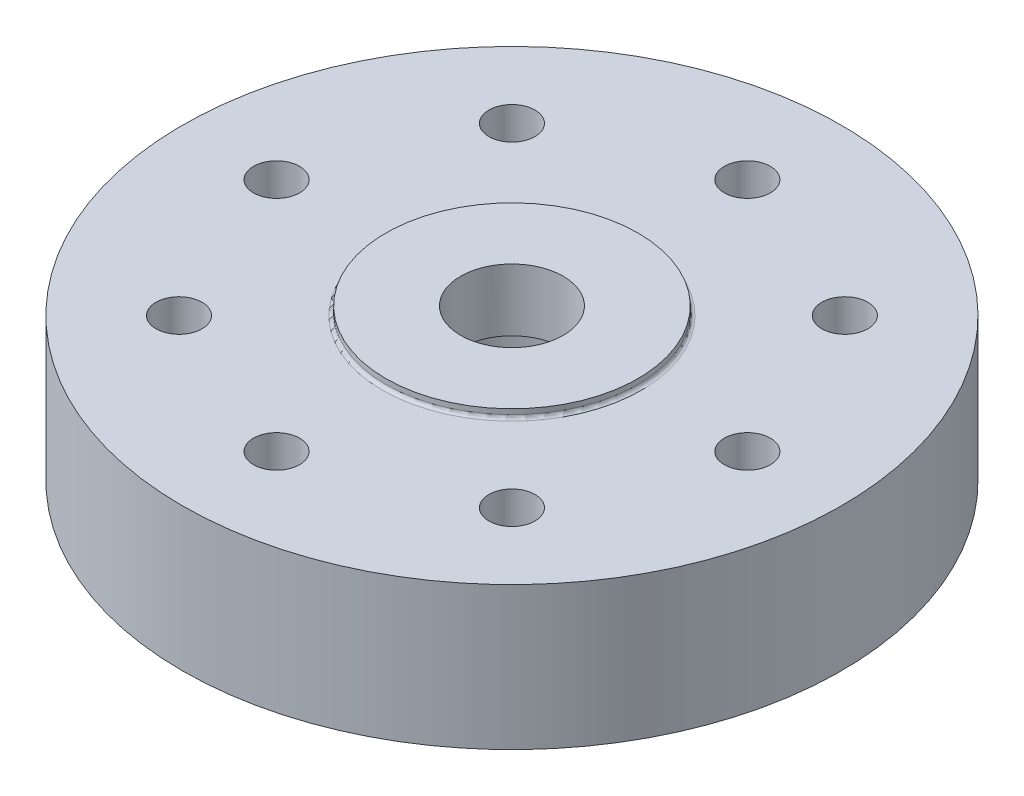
from build123d import *

# Parameters (mm, degrees)
SKETCH1_R                = 9.8
SKETCH1_R_2              = 0.685
SKETCH1_R_3              = 1.525
BOSS_EXTRUDE1_DEPTH      = 4.25
SHELL3_T                 = -1.2
BOSS_EXTRUDE2_DEPTH      = 0.5
BOSS_EXTRUDE2_DEPTH_BACK = 4.25
SKETCH2_R                = 4.4
SKETCH2_R_2              = 1.525
SKETCH3_R                = 2.5
CUT_EXTRUDE1_DEPTH       = 3.15
SKETCH4_R                = 3.75
SKETCH4_R_2              = 1.525
BOSS_EXTRUDE3_DEPTH      = 0.25
FILLET1_R                = 0.1


with BuildPart() as part:
    # Sketch1 → Boss-Extrude1 (new body)
    with BuildSketch(Plane(origin=(0, 0, 0), x_dir=(1, 0, 0), z_dir=(0, 1, 0))):
        with Locations(Location((0, 0, 0), (0, 0, 270))):
            Circle(SKETCH1_R)
        with Locations(Location((0, 7, 0), (0, 0, 270))):
            Circle(SKETCH1_R_2, mode=Mode.SUBTRACT)
        with Locations(Location((4.949747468, 4.949747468, 0), (0, 0, 270))):
            Circle(SKETCH1_R_2, mode=Mode.SUBTRACT)
        with Locations(Location((7, 0, 0), (0, 0, 270))):
            Circle(SKETCH1_R_2, mode=Mode.SUBTRACT)
        with Locations(Location((4.949747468, -4.949747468, 0), (0, 0, 270))):
            Circle(SKETCH1_R_2, mode=Mode.SUBTRACT)
        with Locations(Location((0, -7, 0), (0, 0, 270))):
            Circle(SKETCH1_R_2, mode=Mode.SUBTRACT)
        with Locations(Location((-4.949747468, -4.949747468, 0), (0, 0, 270))):
            Circle(SKETCH1_R_2, mode=Mode.SUBTRACT)
        with Locations(Location((-7, 0, 0), (0, 0, 270))):
            Circle(SKETCH1_R_2, mode=Mode.SUBTRACT)
        with Locations(Location((-4.949747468, 4.949747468, 0), (0, 0, 270))):
            Circle(SKETCH1_R_2, mode=Mode.SUBTRACT)
        with Locations(Location((0, 0, 0), (0, 0, 270))):
            Circle(SKETCH1_R_3, mode=Mode.SUBTRACT)
    extrude(amount=BOSS_EXTRUDE1_DEPTH)

    # Shell3
    shell3_openings = [part.faces().sort_by_distance(p)[0] for p in [
        (0, 0, -9.522814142),
    ]]
    offset(amount=SHELL3_T, openings=shell3_openings)

    # Sketch2 → Boss-Extrude2 (add, two sides: drawn at the far end of the back side and taken through both)
    with BuildSketch(Plane.XZ.offset(-BOSS_EXTRUDE2_DEPTH_BACK)):
        with Locations(Location((0, 0, 0), (0, 0, 270))):
            Circle(SKETCH2_R)
        with Locations(Location((0, 0, 0), (0, 0, 270))):
            Circle(SKETCH2_R_2, mode=Mode.SUBTRACT)
    extrude(amount=BOSS_EXTRUDE2_DEPTH + BOSS_EXTRUDE2_DEPTH_BACK)

    # Sketch3 → Cut-Extrude1 (cut)
    with BuildSketch(Plane.XZ.offset(0.5)):
        with Locations(Location((0, 0, 0), (0, 0, 270))):
            Circle(SKETCH3_R)
    extrude(amount=-CUT_EXTRUDE1_DEPTH, mode=Mode.SUBTRACT)

    # Sketch4 → Boss-Extrude3 (add)
    with BuildSketch(Plane(origin=(0, 4.25, 0), x_dir=(1, 0, 0), z_dir=(0, 1, 0))):
        with Locations(Location((0, 0, 0), (0, 0, 270))):
            Circle(SKETCH4_R)
        with Locations(Location((0, 0, 0), (0, 0, 90))):
            Circle(SKETCH4_R_2, mode=Mode.SUBTRACT)
    extrude(amount=BOSS_EXTRUDE3_DEPTH)

    # Fillet1
    fillet1_edges = [part.edges().sort_by_distance(p)[0] for p in [
        (0, 4.25, -3.75),
    ]]
    fillet(fillet1_edges, radius=FILLET1_R)


solid = part.part
